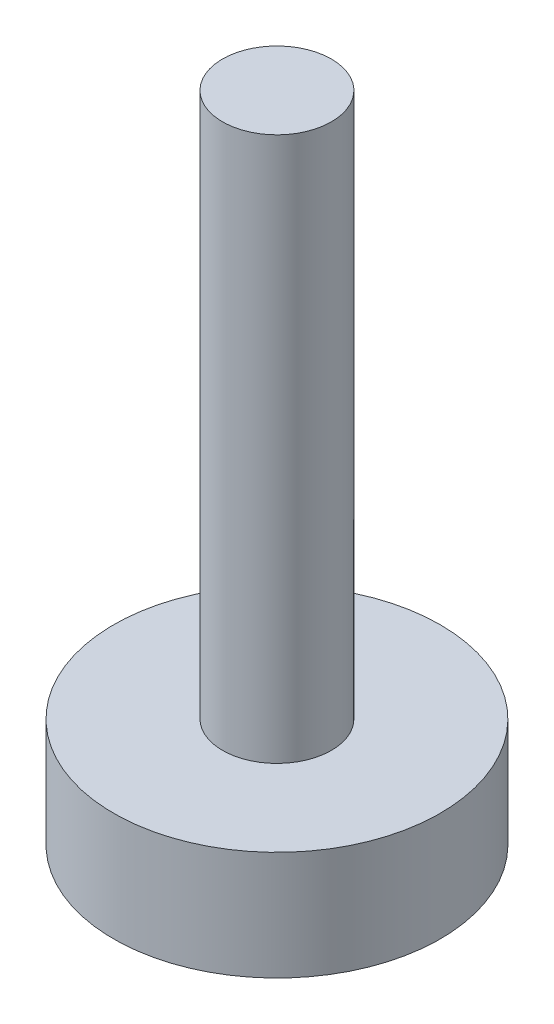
ISO-10303-21;
HEADER;
FILE_DESCRIPTION(('STEP AP214'),'2;1');
FILE_NAME('part.step','',(''),(''),'','','');
FILE_SCHEMA(('AUTOMOTIVE_DESIGN { 1 0 10303 214 1 1 1 1 }'));
ENDSEC;
DATA;
#1=APPLICATION_CONTEXT('core data for automotive mechanical design processes');
#2=APPLICATION_PROTOCOL_DEFINITION('international standard','automotive_design',2000,#1);
#3=PRODUCT_CONTEXT('',#1,'mechanical');
#4=PRODUCT('Part','Part','',(#3));
#5=PRODUCT_RELATED_PRODUCT_CATEGORY('part','',(#4));
#6=PRODUCT_DEFINITION_FORMATION('','',#4);
#7=PRODUCT_DEFINITION_CONTEXT('part definition',#1,'design');
#8=PRODUCT_DEFINITION('design','',#6,#7);
#9=PRODUCT_DEFINITION_SHAPE('','',#8);
#10=(LENGTH_UNIT() NAMED_UNIT(*) SI_UNIT(.MILLI.,.METRE.));
#11=(NAMED_UNIT(*) PLANE_ANGLE_UNIT() SI_UNIT($,.RADIAN.));
#12=(NAMED_UNIT(*) SI_UNIT($,.STERADIAN.) SOLID_ANGLE_UNIT());
#13=UNCERTAINTY_MEASURE_WITH_UNIT(LENGTH_MEASURE(1.E-05),#10,'distance_accuracy_value','');
#14=(GEOMETRIC_REPRESENTATION_CONTEXT(3) GLOBAL_UNCERTAINTY_ASSIGNED_CONTEXT((#13)) GLOBAL_UNIT_ASSIGNED_CONTEXT((#10,
#11,#12)) REPRESENTATION_CONTEXT('',''));
#15=CARTESIAN_POINT('',(0.,0.,0.));
#16=DIRECTION('',(0.,0.,1.));
#17=DIRECTION('',(1.,0.,0.));
#18=AXIS2_PLACEMENT_3D('',#15,#16,#17);
#19=CARTESIAN_POINT('',(0.,0.,0.));
#20=DIRECTION('',(0.,-1.,0.));
#21=DIRECTION('',(0.,0.,-1.));
#22=AXIS2_PLACEMENT_3D('',#19,#20,#21);
#23=PLANE('',#22);
#24=CARTESIAN_POINT('',(0.,0.,0.));
#25=DIRECTION('',(0.,-1.,0.));
#26=DIRECTION('',(0.,0.,-1.));
#27=AXIS2_PLACEMENT_3D('',#24,#25,#26);
#28=CIRCLE('',#27,19.05);
#29=CARTESIAN_POINT('',(0.,0.,-19.05));
#30=VERTEX_POINT('',#29);
#31=EDGE_CURVE('E10',#30,#30,#28,.T.);
#32=ORIENTED_EDGE('',*,*,#31,.T.);
#33=EDGE_LOOP('',(#32));
#34=FACE_BOUND('',#33,.T.);
#35=ADVANCED_FACE('F32',(#34),#23,.T.);
#36=CARTESIAN_POINT('',(0.,0.,0.));
#37=DIRECTION('',(0.,-1.,0.));
#38=DIRECTION('',(0.,0.,-1.));
#39=AXIS2_PLACEMENT_3D('',#36,#37,#38);
#40=CYLINDRICAL_SURFACE('',#39,19.05);
#41=CARTESIAN_POINT('',(0.,12.7,0.));
#42=DIRECTION('',(0.,-1.,0.));
#43=DIRECTION('',(0.,0.,-1.));
#44=AXIS2_PLACEMENT_3D('',#41,#42,#43);
#45=CIRCLE('',#44,19.05);
#46=CARTESIAN_POINT('',(0.,12.7,-19.05));
#47=VERTEX_POINT('',#46);
#48=EDGE_CURVE('E38',#47,#47,#45,.T.);
#49=ORIENTED_EDGE('',*,*,#48,.T.);
#50=EDGE_LOOP('',(#49));
#51=FACE_BOUND('',#50,.T.);
#52=ORIENTED_EDGE('',*,*,#31,.F.);
#53=EDGE_LOOP('',(#52));
#54=FACE_BOUND('',#53,.T.);
#55=ADVANCED_FACE('F64',(#51,#54),#40,.T.);
#56=CARTESIAN_POINT('',(19.05,12.7,0.));
#57=DIRECTION('',(0.,1.,0.));
#58=DIRECTION('',(0.,0.,1.));
#59=AXIS2_PLACEMENT_3D('',#56,#57,#58);
#60=PLANE('',#59);
#61=CARTESIAN_POINT('',(0.,12.7,0.));
#62=DIRECTION('',(0.,-1.,0.));
#63=DIRECTION('',(0.,0.,-1.));
#64=AXIS2_PLACEMENT_3D('',#61,#62,#63);
#65=CIRCLE('',#64,6.35);
#66=CARTESIAN_POINT('',(0.,12.7,-6.35));
#67=VERTEX_POINT('',#66);
#68=EDGE_CURVE('E42',#67,#67,#65,.T.);
#69=ORIENTED_EDGE('',*,*,#68,.T.);
#70=EDGE_LOOP('',(#69));
#71=FACE_BOUND('',#70,.T.);
#72=ORIENTED_EDGE('',*,*,#48,.F.);
#73=EDGE_LOOP('',(#72));
#74=FACE_BOUND('',#73,.T.);
#75=ADVANCED_FACE('F61',(#71,#74),#60,.T.);
#76=CARTESIAN_POINT('',(0.,0.,0.));
#77=DIRECTION('',(0.,-1.,0.));
#78=DIRECTION('',(0.,0.,-1.));
#79=AXIS2_PLACEMENT_3D('',#76,#77,#78);
#80=CYLINDRICAL_SURFACE('',#79,6.35);
#81=CARTESIAN_POINT('',(0.,76.2,0.));
#82=DIRECTION('',(0.,-1.,0.));
#83=DIRECTION('',(0.,0.,-1.));
#84=AXIS2_PLACEMENT_3D('',#81,#82,#83);
#85=CIRCLE('',#84,6.35);
#86=CARTESIAN_POINT('',(0.,76.2,-6.35));
#87=VERTEX_POINT('',#86);
#88=EDGE_CURVE('E46',#87,#87,#85,.T.);
#89=ORIENTED_EDGE('',*,*,#88,.T.);
#90=EDGE_LOOP('',(#89));
#91=FACE_BOUND('',#90,.T.);
#92=ORIENTED_EDGE('',*,*,#68,.F.);
#93=EDGE_LOOP('',(#92));
#94=FACE_BOUND('',#93,.T.);
#95=ADVANCED_FACE('F52',(#91,#94),#80,.T.);
#96=CARTESIAN_POINT('',(6.35,76.2,0.));
#97=DIRECTION('',(0.,1.,0.));
#98=DIRECTION('',(0.,0.,1.));
#99=AXIS2_PLACEMENT_3D('',#96,#97,#98);
#100=PLANE('',#99);
#101=ORIENTED_EDGE('',*,*,#88,.F.);
#102=EDGE_LOOP('',(#101));
#103=FACE_BOUND('',#102,.T.);
#104=ADVANCED_FACE('F55',(#103),#100,.T.);
#105=CLOSED_SHELL('',(#35,#55,#75,#95,#104));
#106=MANIFOLD_SOLID_BREP('B2',#105);
#107=ADVANCED_BREP_SHAPE_REPRESENTATION('',(#18,#106),#14);
#108=SHAPE_DEFINITION_REPRESENTATION(#9,#107);
ENDSEC;
END-ISO-10303-21;
